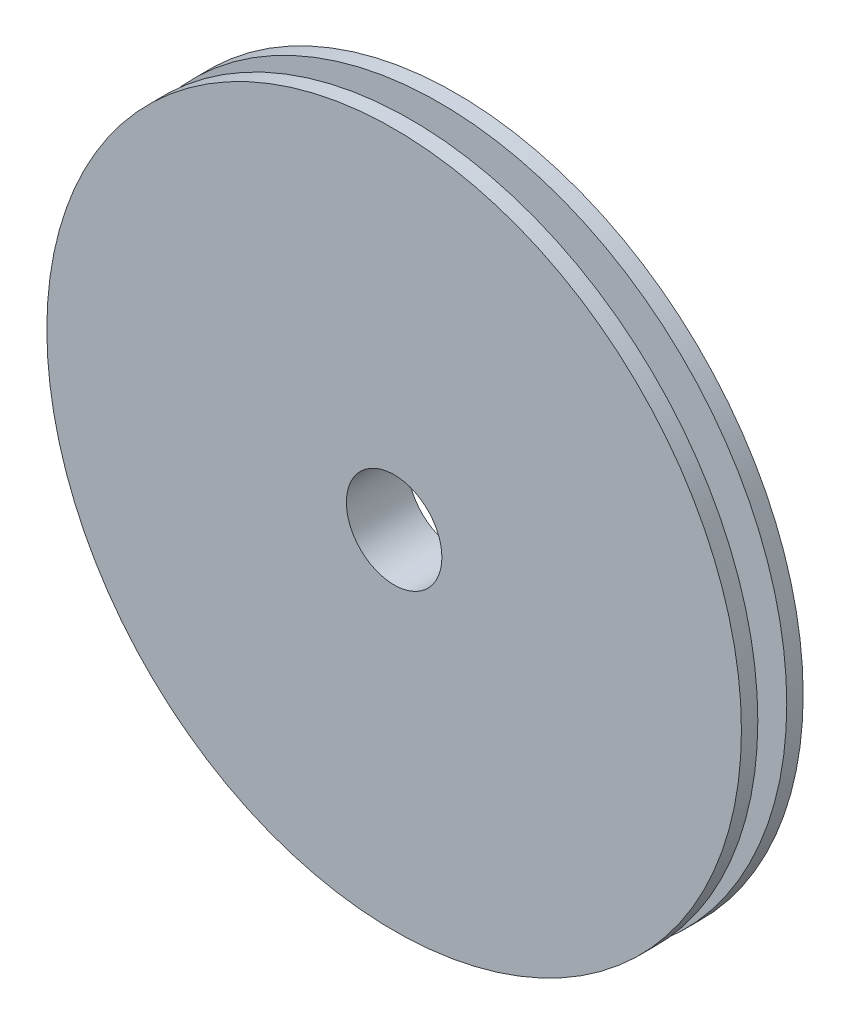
from build123d import *

# Parameters (mm, degrees)
SKETCH1_R               = 18
BOSS_EXTRUDE1_DEPTH     = 3.2
CUT_EXTRUDE1_DEPTH      = 17
CUT_EXTRUDE1_DEPTH_BACK = 43
SKETCH2_R               = 2.475
SKETCH5_R               = 18
SKETCH5_R_2             = 15.5
CUT_EXTRUDE4_DEPTH      = 0.75


with BuildPart() as part:
    # Sketch1 → Boss-Extrude1 (new body)
    with BuildSketch(Plane.XY.offset(30)):
        Circle(SKETCH1_R)
    extrude(amount=BOSS_EXTRUDE1_DEPTH)

    # Sketch2 → Cut-Extrude1 (cut, two sides: drawn at the far end of the back side and taken through both)
    with BuildSketch(Plane.XY.offset(33.2).offset(-CUT_EXTRUDE1_DEPTH_BACK)):
        Circle(SKETCH2_R)
    extrude(amount=CUT_EXTRUDE1_DEPTH + CUT_EXTRUDE1_DEPTH_BACK, mode=Mode.SUBTRACT)

    # Sketch5 → Cut-Extrude4 (cut, symmetric)
    with BuildSketch(Plane.XY.offset(31.6)):
        Circle(SKETCH5_R)
        Circle(SKETCH5_R_2, mode=Mode.SUBTRACT)
    extrude(amount=CUT_EXTRUDE4_DEPTH, both=True, mode=Mode.SUBTRACT)


solid = part.part
